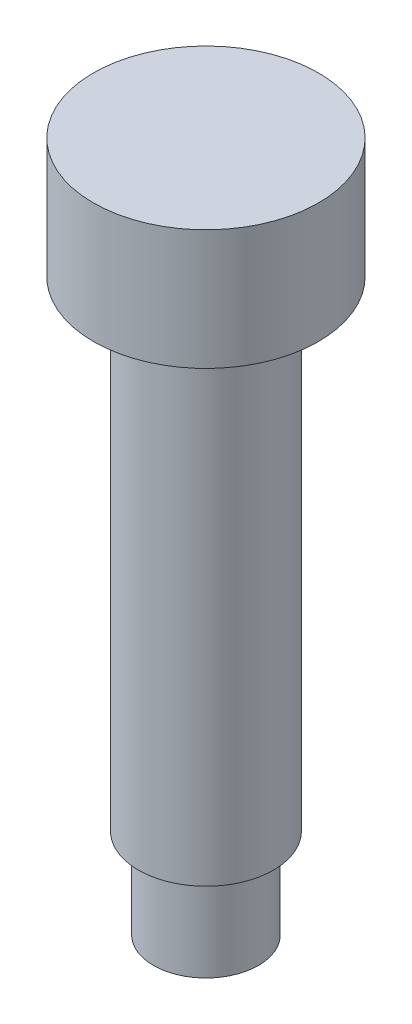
from build123d import *


with BuildPart() as part:
    # Sketch1 → Revolve1 (revolve)
    with BuildSketch(Plane.XY, mode=Mode.PRIVATE) as revolve1_sk:
        Polygon((0, 0), (0, 18.25625), (2.9765625, 18.25625), (2.9765625, 15.08125), (1.7859375, 15.08125), (1.7859375, 2.38125), (1.3890625, 2.38125), (1.3890625, 0), align=None)
    revolve(revolve1_sk.sketch.rotate(Axis((0, 0, 0), (0, -1, 0)), 90), axis=Axis((0, 0, 0), (0, -1, 0)))


solid = part.part
